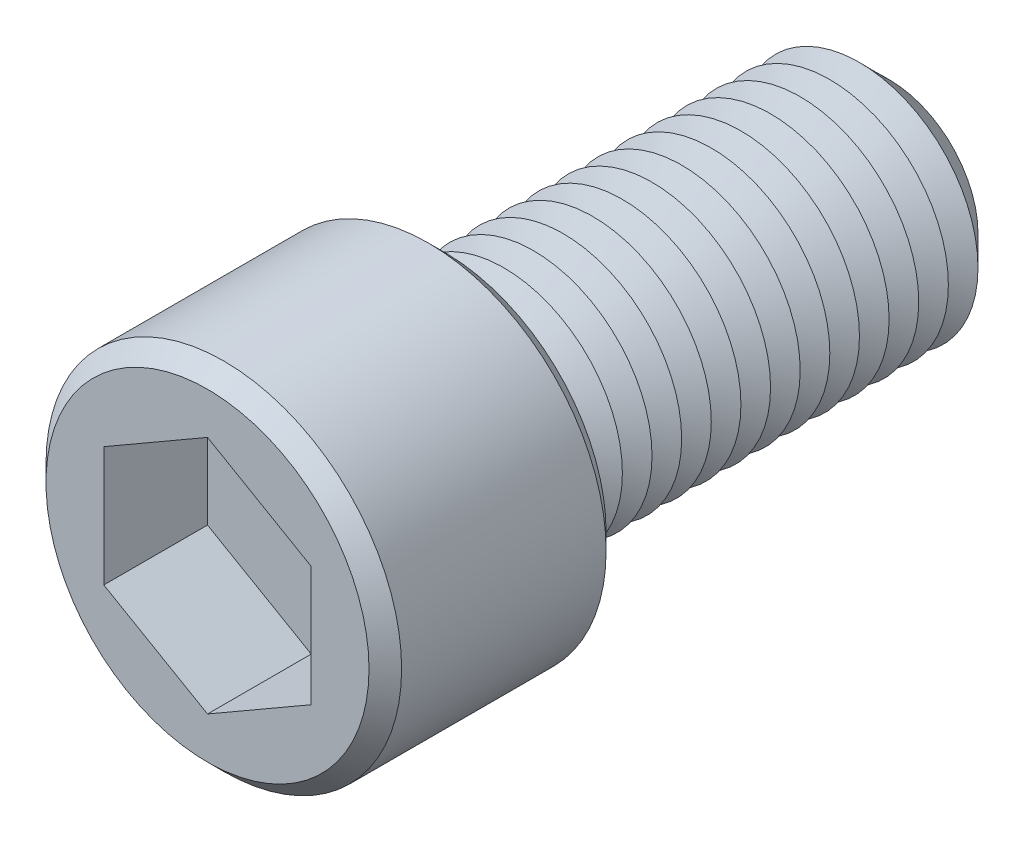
from build123d import *

# Parameters (mm, degrees)
SKETCH1_R           = 12
BOSS_EXTRUDE1_DEPTH = 16
SKETCH2_R           = 8
BOSS_EXTRUDE2_DEPTH = 30
CHAMFER1_SIZE       = 2
LPATTERN1_COUNT     = 14
LPATTERN1_PITCH     = 2
CUT_EXTRUDE1_DEPTH  = 7
SKETCH6_R           = 0.9
CUT_EXTRUDE2_DEPTH  = 39
CHAMFER2_SIZE       = 1.1


with BuildPart() as part:
    # Sketch1 → Boss-Extrude1 (new body)
    with BuildSketch(Plane.XY):
        Circle(SKETCH1_R)
    extrude(amount=BOSS_EXTRUDE1_DEPTH)

    # Sketch2 → Boss-Extrude2 (add)
    with BuildSketch(Plane(origin=(0, 0, 0), x_dir=(-1, 0, 0), z_dir=(0, 0, -1))):
        Circle(SKETCH2_R)
    extrude(amount=BOSS_EXTRUDE2_DEPTH)

    # Chamfer1
    chamfer1_edges = [part.edges().sort_by_distance(p)[0] for p in [
        (8, 0, -30),
    ]]
    chamfer(chamfer1_edges, length=CHAMFER1_SIZE)

    # Sketch4 → Cut-Revolve1 (revolve, cut)
    with BuildSketch(Plane(origin=(0, 0, 0), x_dir=(0, 0, -1), z_dir=(1, 0, 0)), mode=Mode.PRIVATE) as cut_revolve1_sk:
        Polygon((0, 8), (1, 6.267949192), (2, 8), align=None)
    cut_revolve1 = revolve(cut_revolve1_sk.sketch.rotate(Axis((0, 0, 2.512122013), (0, 0, -1)), 90), axis=Axis((0, 0, 2.512122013), (0, 0, -1)), mode=Mode.SUBTRACT)

    # LPattern1: Cut-Revolve1 ×14
    with Locations(*[(0, 0, -i * LPATTERN1_PITCH) for i in range(1, LPATTERN1_COUNT)]):
        add(cut_revolve1, mode=Mode.SUBTRACT)

    # Sketch5 → Cut-Extrude1 (cut)
    with BuildSketch(Plane.XY.offset(16)):
        Polygon((0, 8.082903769), (-7, 4.041451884), (-7, -4.041451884), (0, -8.082903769), (7, -4.041451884), (7, 4.041451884), align=None)
    extrude(amount=-CUT_EXTRUDE1_DEPTH, mode=Mode.SUBTRACT)

    # Sketch6 → Cut-Extrude2 (cut)
    with BuildSketch(Plane.XY.offset(9)):
        Circle(SKETCH6_R)
    extrude(amount=-CUT_EXTRUDE2_DEPTH, mode=Mode.SUBTRACT)

    # Chamfer2
    chamfer2_edges = [part.edges().sort_by_distance(p)[0] for p in [
        (-12, 0, 0),
        (-12, 0, 16),
    ]]
    chamfer(chamfer2_edges, length=CHAMFER2_SIZE)


solid = part.part
